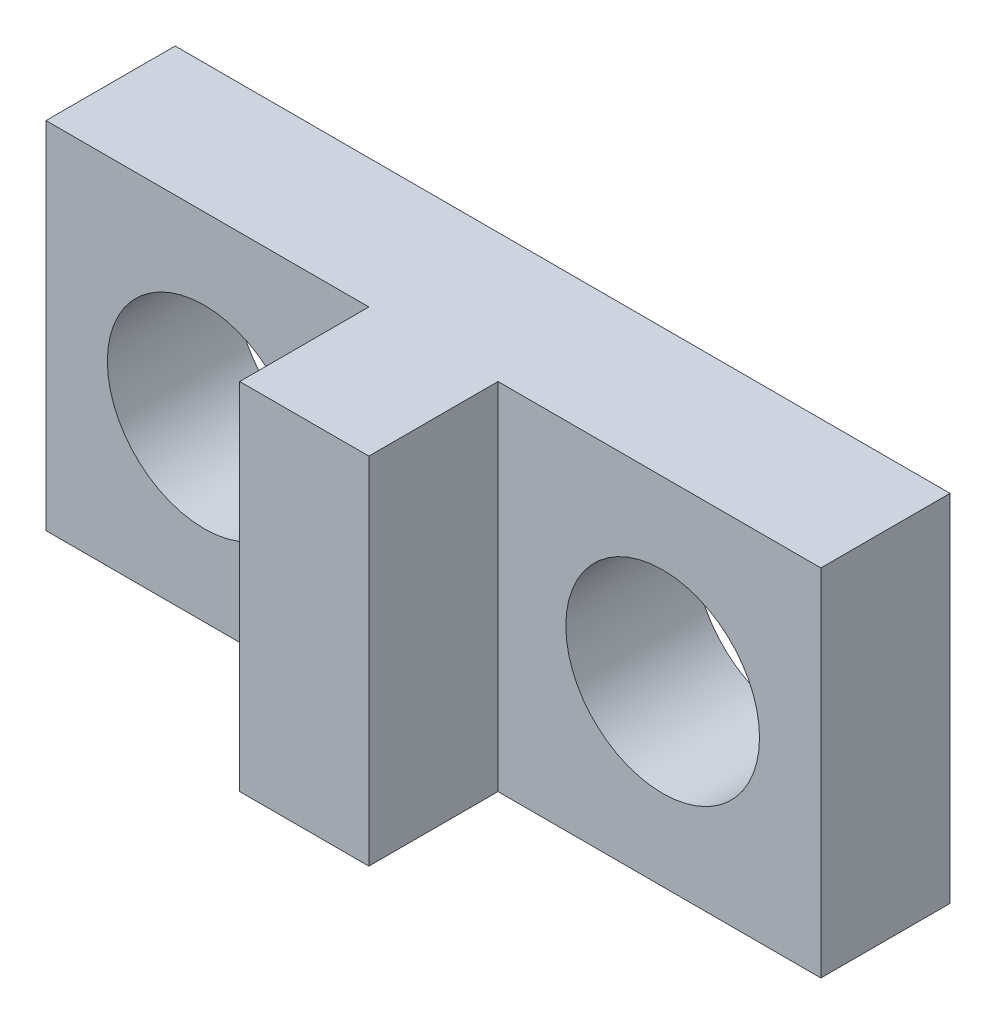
ISO-10303-21;
HEADER;
FILE_DESCRIPTION(('STEP AP214'),'2;1');
FILE_NAME('part.step','',(''),(''),'','','');
FILE_SCHEMA(('AUTOMOTIVE_DESIGN { 1 0 10303 214 1 1 1 1 }'));
ENDSEC;
DATA;
#1=APPLICATION_CONTEXT('core data for automotive mechanical design processes');
#2=APPLICATION_PROTOCOL_DEFINITION('international standard','automotive_design',2000,#1);
#3=PRODUCT_CONTEXT('',#1,'mechanical');
#4=PRODUCT('Part','Part','',(#3));
#5=PRODUCT_RELATED_PRODUCT_CATEGORY('part','',(#4));
#6=PRODUCT_DEFINITION_FORMATION('','',#4);
#7=PRODUCT_DEFINITION_CONTEXT('part definition',#1,'design');
#8=PRODUCT_DEFINITION('design','',#6,#7);
#9=PRODUCT_DEFINITION_SHAPE('','',#8);
#10=(LENGTH_UNIT() NAMED_UNIT(*) SI_UNIT(.MILLI.,.METRE.));
#11=(NAMED_UNIT(*) PLANE_ANGLE_UNIT() SI_UNIT($,.RADIAN.));
#12=(NAMED_UNIT(*) SI_UNIT($,.STERADIAN.) SOLID_ANGLE_UNIT());
#13=UNCERTAINTY_MEASURE_WITH_UNIT(LENGTH_MEASURE(1.E-05),#10,'distance_accuracy_value','');
#14=(GEOMETRIC_REPRESENTATION_CONTEXT(3) GLOBAL_UNCERTAINTY_ASSIGNED_CONTEXT((#13)) GLOBAL_UNIT_ASSIGNED_CONTEXT((#10,
#11,#12)) REPRESENTATION_CONTEXT('',''));
#15=CARTESIAN_POINT('',(0.,0.,0.));
#16=DIRECTION('',(0.,0.,1.));
#17=DIRECTION('',(1.,0.,0.));
#18=AXIS2_PLACEMENT_3D('',#15,#16,#17);
#19=CARTESIAN_POINT('',(0.,0.,2.));
#20=DIRECTION('',(0.,0.,1.));
#21=DIRECTION('',(1.,0.,0.));
#22=AXIS2_PLACEMENT_3D('',#19,#20,#21);
#23=PLANE('',#22);
#24=DIRECTION('',(0.,1.,0.));
#25=VECTOR('',#24,1.);
#26=CARTESIAN_POINT('',(1.,2.75,2.));
#27=LINE('',#26,#25);
#28=CARTESIAN_POINT('',(1.,-2.75,2.));
#29=VERTEX_POINT('',#28);
#30=CARTESIAN_POINT('',(1.,2.75,2.));
#31=VERTEX_POINT('',#30);
#32=EDGE_CURVE('E122',#29,#31,#27,.T.);
#33=ORIENTED_EDGE('',*,*,#32,.F.);
#34=DIRECTION('',(1.,0.,0.));
#35=VECTOR('',#34,1.);
#36=CARTESIAN_POINT('',(6.,-2.75,2.));
#37=LINE('',#36,#35);
#38=CARTESIAN_POINT('',(6.,-2.75,2.));
#39=VERTEX_POINT('',#38);
#40=EDGE_CURVE('E144',#29,#39,#37,.T.);
#41=ORIENTED_EDGE('',*,*,#40,.T.);
#42=DIRECTION('',(0.,1.,0.));
#43=VECTOR('',#42,1.);
#44=CARTESIAN_POINT('',(6.,-2.75,2.));
#45=LINE('',#44,#43);
#46=CARTESIAN_POINT('',(6.,2.75,2.));
#47=VERTEX_POINT('',#46);
#48=EDGE_CURVE('E148',#39,#47,#45,.T.);
#49=ORIENTED_EDGE('',*,*,#48,.T.);
#50=DIRECTION('',(-1.,0.,0.));
#51=VECTOR('',#50,1.);
#52=CARTESIAN_POINT('',(6.,2.75,2.));
#53=LINE('',#52,#51);
#54=EDGE_CURVE('E59',#47,#31,#53,.T.);
#55=ORIENTED_EDGE('',*,*,#54,.T.);
#56=EDGE_LOOP('',(#33,#41,#49,#55));
#57=FACE_BOUND('',#56,.T.);
#58=CARTESIAN_POINT('',(3.55,0.,2.));
#59=DIRECTION('',(0.,0.,1.));
#60=DIRECTION('',(1.,0.,0.));
#61=AXIS2_PLACEMENT_3D('',#58,#59,#60);
#62=CIRCLE('',#61,1.5);
#63=CARTESIAN_POINT('',(5.05,0.,2.));
#64=VERTEX_POINT('',#63);
#65=EDGE_CURVE('E126',#64,#64,#62,.T.);
#66=ORIENTED_EDGE('',*,*,#65,.F.);
#67=EDGE_LOOP('',(#66));
#68=FACE_BOUND('',#67,.T.);
#69=ADVANCED_FACE('F36',(#57,#68),#23,.T.);
#70=DIRECTION('',(0.,-1.,0.));
#71=VECTOR('',#70,1.);
#72=CARTESIAN_POINT('',(-1.,2.75,2.));
#73=LINE('',#72,#71);
#74=CARTESIAN_POINT('',(-1.,2.75,2.));
#75=VERTEX_POINT('',#74);
#76=CARTESIAN_POINT('',(-1.,-2.75,2.));
#77=VERTEX_POINT('',#76);
#78=EDGE_CURVE('E51',#75,#77,#73,.T.);
#79=ORIENTED_EDGE('',*,*,#78,.F.);
#80=CARTESIAN_POINT('',(-6.,2.75,2.));
#81=VERTEX_POINT('',#80);
#82=EDGE_CURVE('E150',#75,#81,#53,.T.);
#83=ORIENTED_EDGE('',*,*,#82,.T.);
#84=DIRECTION('',(0.,-1.,0.));
#85=VECTOR('',#84,1.);
#86=CARTESIAN_POINT('',(-6.,-2.75,2.));
#87=LINE('',#86,#85);
#88=CARTESIAN_POINT('',(-6.,-2.75,2.));
#89=VERTEX_POINT('',#88);
#90=EDGE_CURVE('E141',#81,#89,#87,.T.);
#91=ORIENTED_EDGE('',*,*,#90,.T.);
#92=EDGE_CURVE('E146',#89,#77,#37,.T.);
#93=ORIENTED_EDGE('',*,*,#92,.T.);
#94=EDGE_LOOP('',(#79,#83,#91,#93));
#95=FACE_BOUND('',#94,.T.);
#96=CARTESIAN_POINT('',(-3.55,0.,2.));
#97=DIRECTION('',(0.,0.,1.));
#98=DIRECTION('',(1.,0.,0.));
#99=AXIS2_PLACEMENT_3D('',#96,#97,#98);
#100=CIRCLE('',#99,1.5);
#101=CARTESIAN_POINT('',(-2.05,0.,2.));
#102=VERTEX_POINT('',#101);
#103=EDGE_CURVE('E135',#102,#102,#100,.T.);
#104=ORIENTED_EDGE('',*,*,#103,.F.);
#105=EDGE_LOOP('',(#104));
#106=FACE_BOUND('',#105,.T.);
#107=ADVANCED_FACE('F182',(#95,#106),#23,.T.);
#108=CARTESIAN_POINT('',(0.,0.,0.));
#109=DIRECTION('',(0.,0.,1.));
#110=DIRECTION('',(1.,0.,0.));
#111=AXIS2_PLACEMENT_3D('',#108,#109,#110);
#112=PLANE('',#111);
#113=DIRECTION('',(0.,-1.,0.));
#114=VECTOR('',#113,1.);
#115=CARTESIAN_POINT('',(-6.,-2.75,0.));
#116=LINE('',#115,#114);
#117=CARTESIAN_POINT('',(-6.,2.75,0.));
#118=VERTEX_POINT('',#117);
#119=CARTESIAN_POINT('',(-6.,-2.75,0.));
#120=VERTEX_POINT('',#119);
#121=EDGE_CURVE('E138',#118,#120,#116,.T.);
#122=ORIENTED_EDGE('',*,*,#121,.F.);
#123=DIRECTION('',(-1.,0.,0.));
#124=VECTOR('',#123,1.);
#125=CARTESIAN_POINT('',(6.,2.75,0.));
#126=LINE('',#125,#124);
#127=CARTESIAN_POINT('',(6.,2.75,0.));
#128=VERTEX_POINT('',#127);
#129=EDGE_CURVE('E145',#128,#118,#126,.T.);
#130=ORIENTED_EDGE('',*,*,#129,.F.);
#131=DIRECTION('',(0.,1.,0.));
#132=VECTOR('',#131,1.);
#133=CARTESIAN_POINT('',(6.,-2.75,0.));
#134=LINE('',#133,#132);
#135=CARTESIAN_POINT('',(6.,-2.75,0.));
#136=VERTEX_POINT('',#135);
#137=EDGE_CURVE('E157',#136,#128,#134,.T.);
#138=ORIENTED_EDGE('',*,*,#137,.F.);
#139=DIRECTION('',(1.,0.,0.));
#140=VECTOR('',#139,1.);
#141=CARTESIAN_POINT('',(6.,-2.75,0.));
#142=LINE('',#141,#140);
#143=EDGE_CURVE('E155',#120,#136,#142,.T.);
#144=ORIENTED_EDGE('',*,*,#143,.F.);
#145=EDGE_LOOP('',(#122,#130,#138,#144));
#146=FACE_BOUND('',#145,.T.);
#147=CARTESIAN_POINT('',(-3.55,0.,0.));
#148=DIRECTION('',(0.,0.,1.));
#149=DIRECTION('',(1.,0.,0.));
#150=AXIS2_PLACEMENT_3D('',#147,#148,#149);
#151=CIRCLE('',#150,1.5);
#152=CARTESIAN_POINT('',(-2.05,0.,0.));
#153=VERTEX_POINT('',#152);
#154=EDGE_CURVE('E133',#153,#153,#151,.T.);
#155=ORIENTED_EDGE('',*,*,#154,.T.);
#156=EDGE_LOOP('',(#155));
#157=FACE_BOUND('',#156,.T.);
#158=CARTESIAN_POINT('',(3.55,0.,0.));
#159=DIRECTION('',(0.,0.,1.));
#160=DIRECTION('',(1.,0.,0.));
#161=AXIS2_PLACEMENT_3D('',#158,#159,#160);
#162=CIRCLE('',#161,1.5);
#163=CARTESIAN_POINT('',(5.05,0.,0.));
#164=VERTEX_POINT('',#163);
#165=EDGE_CURVE('E123',#164,#164,#162,.T.);
#166=ORIENTED_EDGE('',*,*,#165,.T.);
#167=EDGE_LOOP('',(#166));
#168=FACE_BOUND('',#167,.T.);
#169=ADVANCED_FACE('F176',(#146,#157,#168),#112,.F.);
#170=CARTESIAN_POINT('',(-6.,-2.75,2.));
#171=DIRECTION('',(1.,0.,0.));
#172=DIRECTION('',(0.,0.,-1.));
#173=AXIS2_PLACEMENT_3D('',#170,#171,#172);
#174=PLANE('',#173);
#175=ORIENTED_EDGE('',*,*,#121,.T.);
#176=DIRECTION('',(0.,0.,-1.));
#177=VECTOR('',#176,1.);
#178=CARTESIAN_POINT('',(-6.,-2.75,2.));
#179=LINE('',#178,#177);
#180=EDGE_CURVE('E11',#89,#120,#179,.T.);
#181=ORIENTED_EDGE('',*,*,#180,.F.);
#182=ORIENTED_EDGE('',*,*,#90,.F.);
#183=DIRECTION('',(0.,0.,-1.));
#184=VECTOR('',#183,1.);
#185=CARTESIAN_POINT('',(-6.,2.75,2.));
#186=LINE('',#185,#184);
#187=EDGE_CURVE('E152',#81,#118,#186,.T.);
#188=ORIENTED_EDGE('',*,*,#187,.T.);
#189=EDGE_LOOP('',(#175,#181,#182,#188));
#190=FACE_BOUND('',#189,.T.);
#191=ADVANCED_FACE('F38',(#190),#174,.F.);
#192=CARTESIAN_POINT('',(6.,-2.75,2.));
#193=DIRECTION('',(0.,1.,0.));
#194=DIRECTION('',(-1.,0.,0.));
#195=AXIS2_PLACEMENT_3D('',#192,#193,#194);
#196=PLANE('',#195);
#197=ORIENTED_EDGE('',*,*,#143,.T.);
#198=DIRECTION('',(0.,0.,-1.));
#199=VECTOR('',#198,1.);
#200=CARTESIAN_POINT('',(6.,-2.75,2.));
#201=LINE('',#200,#199);
#202=EDGE_CURVE('E44',#39,#136,#201,.T.);
#203=ORIENTED_EDGE('',*,*,#202,.F.);
#204=ORIENTED_EDGE('',*,*,#40,.F.);
#205=DIRECTION('',(0.,0.,-1.));
#206=VECTOR('',#205,1.);
#207=CARTESIAN_POINT('',(1.,-2.75,4.));
#208=LINE('',#207,#206);
#209=CARTESIAN_POINT('',(1.,-2.75,4.));
#210=VERTEX_POINT('',#209);
#211=EDGE_CURVE('E189',#210,#29,#208,.T.);
#212=ORIENTED_EDGE('',*,*,#211,.F.);
#213=DIRECTION('',(1.,0.,0.));
#214=VECTOR('',#213,1.);
#215=CARTESIAN_POINT('',(-1.,-2.75,4.));
#216=LINE('',#215,#214);
#217=CARTESIAN_POINT('',(-1.,-2.75,4.));
#218=VERTEX_POINT('',#217);
#219=EDGE_CURVE('E116',#218,#210,#216,.T.);
#220=ORIENTED_EDGE('',*,*,#219,.F.);
#221=DIRECTION('',(0.,0.,-1.));
#222=VECTOR('',#221,1.);
#223=CARTESIAN_POINT('',(-1.,-2.75,4.));
#224=LINE('',#223,#222);
#225=EDGE_CURVE('E128',#218,#77,#224,.T.);
#226=ORIENTED_EDGE('',*,*,#225,.T.);
#227=ORIENTED_EDGE('',*,*,#92,.F.);
#228=ORIENTED_EDGE('',*,*,#180,.T.);
#229=EDGE_LOOP('',(#197,#203,#204,#212,#220,#226,#227,#228));
#230=FACE_BOUND('',#229,.T.);
#231=ADVANCED_FACE('F194',(#230),#196,.F.);
#232=CARTESIAN_POINT('',(6.,-2.75,2.));
#233=DIRECTION('',(-1.,0.,0.));
#234=DIRECTION('',(0.,0.,1.));
#235=AXIS2_PLACEMENT_3D('',#232,#233,#234);
#236=PLANE('',#235);
#237=ORIENTED_EDGE('',*,*,#137,.T.);
#238=DIRECTION('',(0.,0.,-1.));
#239=VECTOR('',#238,1.);
#240=CARTESIAN_POINT('',(6.,2.75,2.));
#241=LINE('',#240,#239);
#242=EDGE_CURVE('E162',#47,#128,#241,.T.);
#243=ORIENTED_EDGE('',*,*,#242,.F.);
#244=ORIENTED_EDGE('',*,*,#48,.F.);
#245=ORIENTED_EDGE('',*,*,#202,.T.);
#246=EDGE_LOOP('',(#237,#243,#244,#245));
#247=FACE_BOUND('',#246,.T.);
#248=ADVANCED_FACE('F169',(#247),#236,.F.);
#249=CARTESIAN_POINT('',(6.,2.75,2.));
#250=DIRECTION('',(0.,-1.,0.));
#251=DIRECTION('',(1.,0.,0.));
#252=AXIS2_PLACEMENT_3D('',#249,#250,#251);
#253=PLANE('',#252);
#254=ORIENTED_EDGE('',*,*,#129,.T.);
#255=ORIENTED_EDGE('',*,*,#187,.F.);
#256=ORIENTED_EDGE('',*,*,#82,.F.);
#257=DIRECTION('',(0.,0.,-1.));
#258=VECTOR('',#257,1.);
#259=CARTESIAN_POINT('',(-1.,2.75,4.));
#260=LINE('',#259,#258);
#261=CARTESIAN_POINT('',(-1.,2.75,4.));
#262=VERTEX_POINT('',#261);
#263=EDGE_CURVE('E107',#262,#75,#260,.T.);
#264=ORIENTED_EDGE('',*,*,#263,.F.);
#265=DIRECTION('',(-1.,0.,0.));
#266=VECTOR('',#265,1.);
#267=CARTESIAN_POINT('',(-1.,2.75,4.));
#268=LINE('',#267,#266);
#269=CARTESIAN_POINT('',(1.,2.75,4.));
#270=VERTEX_POINT('',#269);
#271=EDGE_CURVE('E100',#270,#262,#268,.T.);
#272=ORIENTED_EDGE('',*,*,#271,.F.);
#273=DIRECTION('',(0.,0.,-1.));
#274=VECTOR('',#273,1.);
#275=CARTESIAN_POINT('',(1.,2.75,4.));
#276=LINE('',#275,#274);
#277=EDGE_CURVE('E104',#270,#31,#276,.T.);
#278=ORIENTED_EDGE('',*,*,#277,.T.);
#279=ORIENTED_EDGE('',*,*,#54,.F.);
#280=ORIENTED_EDGE('',*,*,#242,.T.);
#281=EDGE_LOOP('',(#254,#255,#256,#264,#272,#278,#279,#280));
#282=FACE_BOUND('',#281,.T.);
#283=ADVANCED_FACE('F102',(#282),#253,.F.);
#284=CARTESIAN_POINT('',(-3.55,0.,2.));
#285=DIRECTION('',(0.,0.,-1.));
#286=DIRECTION('',(-1.,0.,0.));
#287=AXIS2_PLACEMENT_3D('',#284,#285,#286);
#288=CYLINDRICAL_SURFACE('',#287,1.5);
#289=ORIENTED_EDGE('',*,*,#103,.T.);
#290=EDGE_LOOP('',(#289));
#291=FACE_BOUND('',#290,.T.);
#292=ORIENTED_EDGE('',*,*,#154,.F.);
#293=EDGE_LOOP('',(#292));
#294=FACE_BOUND('',#293,.T.);
#295=ADVANCED_FACE('F203',(#291,#294),#288,.F.);
#296=CARTESIAN_POINT('',(3.55,0.,2.));
#297=DIRECTION('',(0.,0.,-1.));
#298=DIRECTION('',(-1.,0.,0.));
#299=AXIS2_PLACEMENT_3D('',#296,#297,#298);
#300=CYLINDRICAL_SURFACE('',#299,1.5);
#301=ORIENTED_EDGE('',*,*,#65,.T.);
#302=EDGE_LOOP('',(#301));
#303=FACE_BOUND('',#302,.T.);
#304=ORIENTED_EDGE('',*,*,#165,.F.);
#305=EDGE_LOOP('',(#304));
#306=FACE_BOUND('',#305,.T.);
#307=ADVANCED_FACE('F200',(#303,#306),#300,.F.);
#308=CARTESIAN_POINT('',(1.,2.75,4.));
#309=DIRECTION('',(-1.,0.,0.));
#310=DIRECTION('',(0.,0.,1.));
#311=AXIS2_PLACEMENT_3D('',#308,#309,#310);
#312=PLANE('',#311);
#313=ORIENTED_EDGE('',*,*,#32,.T.);
#314=ORIENTED_EDGE('',*,*,#277,.F.);
#315=DIRECTION('',(0.,1.,0.));
#316=VECTOR('',#315,1.);
#317=CARTESIAN_POINT('',(1.,2.75,4.));
#318=LINE('',#317,#316);
#319=EDGE_CURVE('E111',#210,#270,#318,.T.);
#320=ORIENTED_EDGE('',*,*,#319,.F.);
#321=ORIENTED_EDGE('',*,*,#211,.T.);
#322=EDGE_LOOP('',(#313,#314,#320,#321));
#323=FACE_BOUND('',#322,.T.);
#324=ADVANCED_FACE('F121',(#323),#312,.F.);
#325=CARTESIAN_POINT('',(-1.,2.75,4.));
#326=DIRECTION('',(1.,0.,0.));
#327=DIRECTION('',(0.,0.,-1.));
#328=AXIS2_PLACEMENT_3D('',#325,#326,#327);
#329=PLANE('',#328);
#330=ORIENTED_EDGE('',*,*,#78,.T.);
#331=ORIENTED_EDGE('',*,*,#225,.F.);
#332=DIRECTION('',(0.,-1.,0.));
#333=VECTOR('',#332,1.);
#334=CARTESIAN_POINT('',(-1.,2.75,4.));
#335=LINE('',#334,#333);
#336=EDGE_CURVE('E110',#262,#218,#335,.T.);
#337=ORIENTED_EDGE('',*,*,#336,.F.);
#338=ORIENTED_EDGE('',*,*,#263,.T.);
#339=EDGE_LOOP('',(#330,#331,#337,#338));
#340=FACE_BOUND('',#339,.T.);
#341=ADVANCED_FACE('F185',(#340),#329,.F.);
#342=CARTESIAN_POINT('',(0.,0.,4.));
#343=DIRECTION('',(0.,0.,1.));
#344=DIRECTION('',(1.,0.,0.));
#345=AXIS2_PLACEMENT_3D('',#342,#343,#344);
#346=PLANE('',#345);
#347=ORIENTED_EDGE('',*,*,#319,.T.);
#348=ORIENTED_EDGE('',*,*,#271,.T.);
#349=ORIENTED_EDGE('',*,*,#336,.T.);
#350=ORIENTED_EDGE('',*,*,#219,.T.);
#351=EDGE_LOOP('',(#347,#348,#349,#350));
#352=FACE_BOUND('',#351,.T.);
#353=ADVANCED_FACE('F114',(#352),#346,.T.);
#354=CLOSED_SHELL('',(#69,#107,#169,#191,#231,#248,#283,#295,#307,#324,#341,#353));
#355=MANIFOLD_SOLID_BREP('B2',#354);
#356=ADVANCED_BREP_SHAPE_REPRESENTATION('',(#18,#355),#14);
#357=SHAPE_DEFINITION_REPRESENTATION(#9,#356);
ENDSEC;
END-ISO-10303-21;
